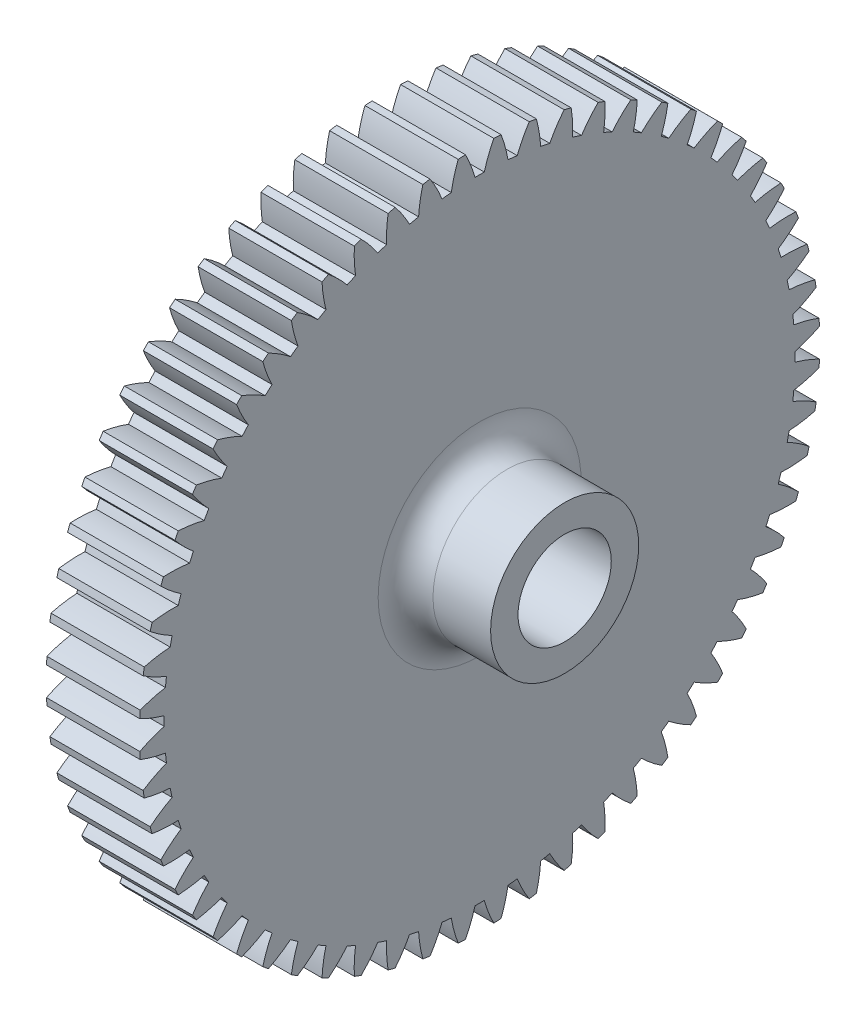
from build123d import *

# Parameters (mm, degrees)
BASPROSKE_W             = 17
BASPROSKE_H             = 62
TOOTHCUT_DEPTH          = 90.314052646
TEETHCUTS_COUNT         = 60
TEETHCUTS_ANGLE         = 354
BORSKE_R                = 0.4
BORE_DEPTH              = 50.0000508
CORTAR_EXTRUIR1_DEPTH   = 90.239284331
CROQUIS2_R              = 13.5
CROQUIS2_R_2            = 8.5
SALIENTE_EXTRUIR1_DEPTH = 15.5
REDONDEO1_R             = 5


with BuildPart() as part:
    # BasProSke → Base-Revolve (revolve)
    with BuildSketch(Plane(origin=(0, 0, 0), x_dir=(1, 0, 0), z_dir=(0, 1, 0)), mode=Mode.PRIVATE) as base_revolve_sk:
        with Locations((8.5, 31)):
            Rectangle(BASPROSKE_W, BASPROSKE_H)
    revolve(base_revolve_sk.sketch.rotate(Axis((-10, 0, 0), (1, 0, 0)), 180), axis=Axis((-10, 0, 0), (1, 0, 0)))

    # TooCutSke → ToothCut (cut, through all)
    with BuildSketch(Plane(origin=(0, 0, 0), x_dir=(0, 0, -1), z_dir=(1, 0, 0))):
        with BuildLine():
            ThreePointArc((0.845486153, 57.492783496), (0, 57.499), (-0.845486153, 57.492783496))
            ThreePointArc((-0.845486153, 57.492783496), (-1.608476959, 59.775867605), (-2.596335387, 61.971035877))
            ThreePointArc((-2.596335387, 61.971035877), (0, 62.0254), (2.596335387, 61.971035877))
            ThreePointArc((2.596335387, 61.971035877), (1.608476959, 59.775867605), (0.845486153, 57.492783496))
        make_face()
    toothcut = extrude(amount=TOOTHCUT_DEPTH, mode=Mode.SUBTRACT)

    # TeethCuts: ToothCut ×60 about axis
    teethcuts_axis = Axis((-10, 0, 0), (1, 0, 0))
    for i in range(1, TEETHCUTS_COUNT):
        add(toothcut.rotate(teethcuts_axis, i * TEETHCUTS_ANGLE / (TEETHCUTS_COUNT - 1)), mode=Mode.SUBTRACT)

    # BorSke → Bore (cut, symmetric)
    with BuildSketch(Plane(origin=(0, 0, 0), x_dir=(0, 0, -1), z_dir=(1, 0, 0))):
        with Locations(Location((0, 0, 0), (0, 0, 180))):
            Circle(BORSKE_R)
    extrude(amount=BORE_DEPTH, both=True, mode=Mode.SUBTRACT)

    # Croquis1 → Cortar-Extruir1 (cut, through all)
    with BuildSketch(Plane(origin=(17, 0, 0), x_dir=(0, 0, -1), z_dir=(1, 0, 0))):
        with BuildLine():
            Line((-0.543347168, 6.828416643), (-0.6, 7.475961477))
            ThreePointArc((-0.6, 7.475961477), (0, 7.5), (0.6, 7.475961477))
            Line((0.6, 7.475961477), (0.543347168, 6.828416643))
            ThreePointArc((0.543347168, 6.828416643), (1.189490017, 6.745933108), (1.824876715, 6.602448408))
            Line((1.824876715, 6.602448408), (1.993113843, 7.230317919))
            ThreePointArc((1.993113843, 7.230317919), (2.565151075, 7.047694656), (3.120744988, 6.819893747))
            Line((3.120744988, 6.819893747), (2.846035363, 6.230777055))
            ThreePointArc((2.846035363, 6.230777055), (3.425, 5.932274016), (3.972993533, 5.580127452))
            Line((3.972993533, 5.580127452), (4.345828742, 6.112591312))
            ThreePointArc((4.345828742, 6.112591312), (4.820907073, 5.745333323), (5.265082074, 5.34124618))
            Line((5.265082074, 5.34124618), (4.805449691, 4.881613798))
            ThreePointArc((4.805449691, 4.881613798), (5.247404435, 4.403095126), (5.641908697, 3.884760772))
            Line((5.641908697, 3.884760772), (6.174372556, 4.257595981))
            ThreePointArc((6.174372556, 4.257595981), (6.495190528, 3.75), (6.774372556, 3.218365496))
            Line((6.774372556, 3.218365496), (6.185255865, 2.943655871))
            ThreePointArc((6.185255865, 2.943655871), (6.436894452, 2.342837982), (6.630326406, 1.72083461))
            Line((6.630326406, 1.72083461), (7.258195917, 1.889071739))
            ThreePointArc((7.258195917, 1.889071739), (7.386058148, 1.302361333), (7.46657373, 0.707302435))
            Line((7.46657373, 0.707302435), (6.819028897, 0.650649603))
            ThreePointArc((6.819028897, 0.650649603), (6.85, 0), (6.819028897, -0.650649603))
            Line((6.819028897, -0.650649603), (7.46657373, -0.707302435))
            ThreePointArc((7.46657373, -0.707302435), (7.386058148, -1.302361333), (7.258195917, -1.889071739))
            Line((7.258195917, -1.889071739), (6.630326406, -1.72083461))
            ThreePointArc((6.630326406, -1.72083461), (6.436894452, -2.342837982), (6.185255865, -2.943655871))
            Line((6.185255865, -2.943655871), (6.774372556, -3.218365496))
            ThreePointArc((6.774372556, -3.218365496), (6.495190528, -3.75), (6.174372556, -4.257595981))
            Line((6.174372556, -4.257595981), (5.641908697, -3.884760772))
            ThreePointArc((5.641908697, -3.884760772), (5.247404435, -4.403095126), (4.805449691, -4.881613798))
            Line((4.805449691, -4.881613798), (5.265082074, -5.34124618))
            ThreePointArc((5.265082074, -5.34124618), (4.820907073, -5.745333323), (4.345828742, -6.112591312))
            Line((4.345828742, -6.112591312), (3.972993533, -5.580127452))
            ThreePointArc((3.972993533, -5.580127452), (3.425, -5.932274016), (2.846035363, -6.230777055))
            Line((2.846035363, -6.230777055), (3.120744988, -6.819893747))
            ThreePointArc((3.120744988, -6.819893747), (2.565151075, -7.047694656), (1.993113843, -7.230317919))
            Line((1.993113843, -7.230317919), (1.824876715, -6.602448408))
            ThreePointArc((1.824876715, -6.602448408), (1.189490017, -6.745933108), (0.543347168, -6.828416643))
            Line((0.543347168, -6.828416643), (0.6, -7.475961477))
            ThreePointArc((0.6, -7.475961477), (0, -7.5), (-0.6, -7.475961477))
            Line((-0.6, -7.475961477), (-0.543347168, -6.828416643))
            ThreePointArc((-0.543347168, -6.828416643), (-1.189490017, -6.745933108), (-1.824876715, -6.602448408))
            Line((-1.824876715, -6.602448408), (-1.993113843, -7.230317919))
            ThreePointArc((-1.993113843, -7.230317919), (-2.565151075, -7.047694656), (-3.120744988, -6.819893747))
            Line((-3.120744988, -6.819893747), (-2.846035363, -6.230777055))
            ThreePointArc((-2.846035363, -6.230777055), (-3.425, -5.932274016), (-3.972993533, -5.580127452))
            Line((-3.972993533, -5.580127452), (-4.345828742, -6.112591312))
            ThreePointArc((-4.345828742, -6.112591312), (-4.820907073, -5.745333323), (-5.265082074, -5.34124618))
            Line((-5.265082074, -5.34124618), (-4.805449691, -4.881613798))
            ThreePointArc((-4.805449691, -4.881613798), (-5.247404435, -4.403095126), (-5.641908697, -3.884760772))
            Line((-5.641908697, -3.884760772), (-6.174372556, -4.257595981))
            ThreePointArc((-6.174372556, -4.257595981), (-6.495190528, -3.75), (-6.774372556, -3.218365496))
            Line((-6.774372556, -3.218365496), (-6.185255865, -2.943655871))
            ThreePointArc((-6.185255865, -2.943655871), (-6.436894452, -2.342837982), (-6.630326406, -1.72083461))
            Line((-6.630326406, -1.72083461), (-7.258195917, -1.889071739))
            ThreePointArc((-7.258195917, -1.889071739), (-7.386058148, -1.302361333), (-7.46657373, -0.707302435))
            Line((-7.46657373, -0.707302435), (-6.819028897, -0.650649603))
            ThreePointArc((-6.819028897, -0.650649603), (-6.85, 0), (-6.819028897, 0.650649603))
            Line((-6.819028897, 0.650649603), (-7.46657373, 0.707302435))
            ThreePointArc((-7.46657373, 0.707302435), (-7.386058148, 1.302361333), (-7.258195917, 1.889071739))
            Line((-7.258195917, 1.889071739), (-6.630326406, 1.72083461))
            ThreePointArc((-6.630326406, 1.72083461), (-6.436894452, 2.342837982), (-6.185255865, 2.943655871))
            Line((-6.185255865, 2.943655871), (-6.774372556, 3.218365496))
            ThreePointArc((-6.774372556, 3.218365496), (-6.495190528, 3.75), (-6.174372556, 4.257595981))
            Line((-6.174372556, 4.257595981), (-5.641908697, 3.884760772))
            ThreePointArc((-5.641908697, 3.884760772), (-5.247404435, 4.403095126), (-4.805449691, 4.881613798))
            Line((-4.805449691, 4.881613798), (-5.265082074, 5.34124618))
            ThreePointArc((-5.265082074, 5.34124618), (-4.820907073, 5.745333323), (-4.345828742, 6.112591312))
            Line((-4.345828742, 6.112591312), (-3.972993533, 5.580127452))
            ThreePointArc((-3.972993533, 5.580127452), (-3.425, 5.932274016), (-2.846035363, 6.230777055))
            Line((-2.846035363, 6.230777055), (-3.120744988, 6.819893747))
            ThreePointArc((-3.120744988, 6.819893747), (-2.565151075, 7.047694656), (-1.993113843, 7.230317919))
            Line((-1.993113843, 7.230317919), (-1.824876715, 6.602448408))
            ThreePointArc((-1.824876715, 6.602448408), (-1.189490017, 6.745933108), (-0.543347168, 6.828416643))
        make_face()
    extrude(amount=-CORTAR_EXTRUIR1_DEPTH, mode=Mode.SUBTRACT)

    # Croquis2 → Saliente-Extruir1 (add)
    with BuildSketch(Plane(origin=(17, 0, 0), x_dir=(0, 0, -1), z_dir=(1, 0, 0))):
        with Locations(Location((0, 0, 0), (0, 0, 180))):
            Circle(CROQUIS2_R)
        Circle(CROQUIS2_R_2, mode=Mode.SUBTRACT)
    extrude(amount=SALIENTE_EXTRUIR1_DEPTH)

    # Redondeo1
    redondeo1_edges = [part.edges().sort_by_distance(p)[0] for p in [
        (17, 0, -13.5),
    ]]
    fillet(redondeo1_edges, radius=REDONDEO1_R)


solid = part.part
